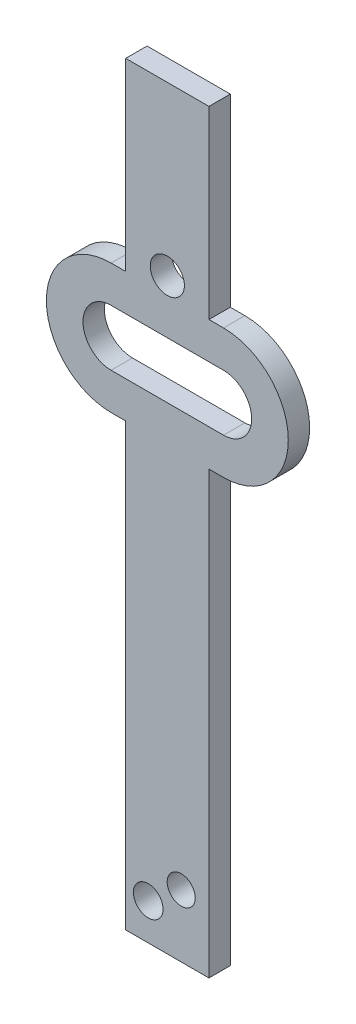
from build123d import *

# Parameters (mm, degrees)
SKETCH1_R           = 2.085
SKETCH1_R_2         = 1.975
SKETCH1_R_3         = 2.4
BOSS_EXTRUDE1_DEPTH = 3
SKETCH2_W           = 2.5
SKETCH2_H           = 2.05
CUT_EXTRUDE1_DEPTH  = 0.49


with BuildPart() as part:
    # Sketch1 → Boss-Extrude1 (new body)
    with BuildSketch(Plane.XY):
        with BuildLine():
            Line((-5.85, 53.045), (-5.85, 27.101350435))
            Line((-5.85, 27.101350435), (-7.9, 27.101350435))
            ThreePointArc((-7.9, 27.101350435), (-17, 18.001350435), (-7.9, 8.901350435))
            Line((-7.9, 8.901350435), (-5.85, 8.901350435))
            Line((-5.85, 8.901350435), (-5.85, -53.045))
            Line((-5.85, -53.045), (-2.685, -53.045))
            Line((-2.685, -53.045), (5.85, -53.045))
            Line((5.85, -53.045), (5.85, 8.901350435))
            Line((5.85, 8.901350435), (7.9, 8.901350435))
            ThreePointArc((7.9, 8.901350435), (17, 18.001350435), (7.9, 27.101350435))
            Line((7.9, 27.101350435), (5.85, 27.101350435))
            Line((5.85, 27.101350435), (5.85, 53.045))
            Line((5.85, 53.045), (-5.85, 53.045))
        make_face()
        with Locations((-2.685, -47.91)):
            Circle(SKETCH1_R, mode=Mode.SUBTRACT)
        with Locations((1.953620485, -44.271379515)):
            Circle(SKETCH1_R_2, mode=Mode.SUBTRACT)
        with BuildLine():
            Line((-7.9, 21.951350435), (7.9, 21.951350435))
            ThreePointArc((7.9, 21.951350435), (11.85, 18.001350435), (7.9, 14.051350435))
            Line((7.9, 14.051350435), (-7.9, 14.051350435))
            ThreePointArc((-7.9, 14.051350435), (-11.85, 18.001350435), (-7.9, 21.951350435))
        make_face(mode=Mode.SUBTRACT)
        with Locations((0, 29.501350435)):
            Circle(SKETCH1_R_3, mode=Mode.SUBTRACT)
    extrude(amount=BOSS_EXTRUDE1_DEPTH)

    # Sketch2 → Cut-Extrude1 (cut)
    with BuildSketch(Plane(origin=(0, 0, 0), x_dir=(-1, 0, 0), z_dir=(0, 0, -1))):
        with Locations((0.045545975, -52.02)):
            Rectangle(SKETCH2_W, SKETCH2_H)
    extrude(amount=-CUT_EXTRUDE1_DEPTH, mode=Mode.SUBTRACT)


solid = part.part
